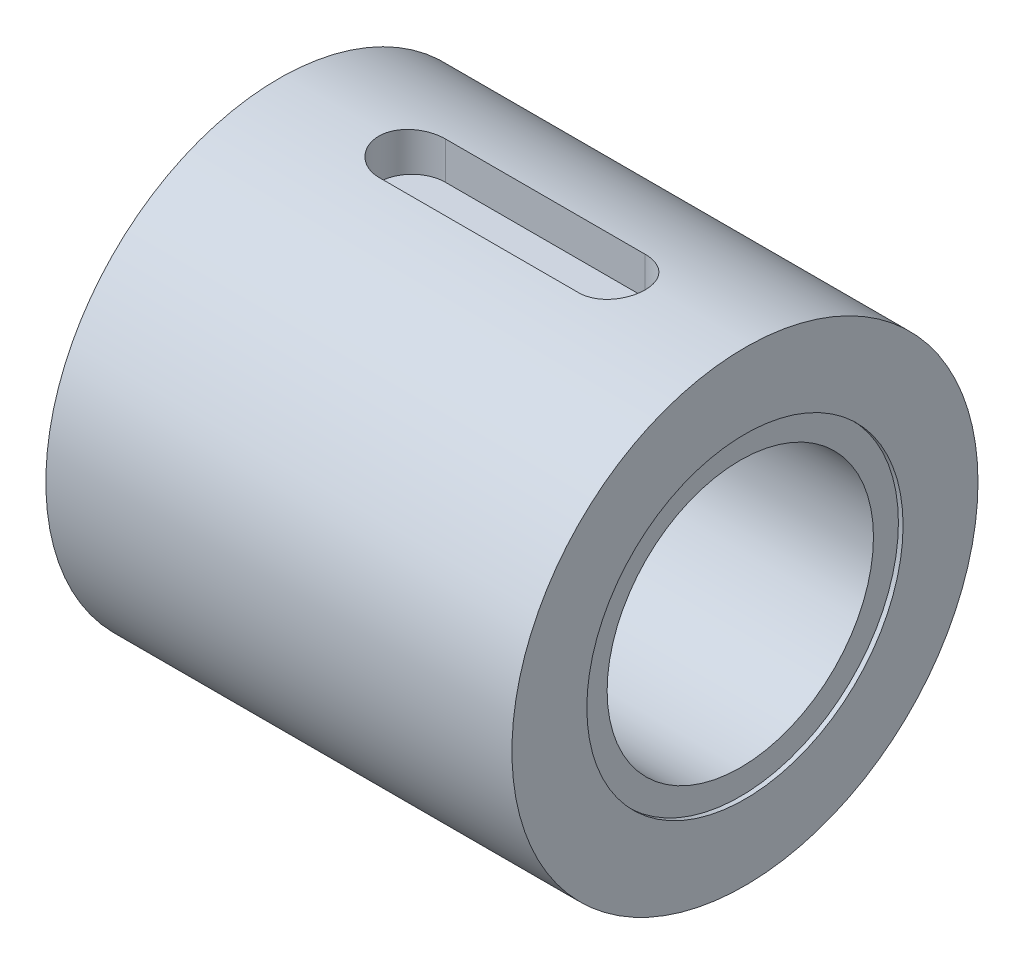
from build123d import *

# Parameters (mm, degrees)
SKETCH1_R          = 7
SKETCH1_R_2        = 4
EXTRUDE1_DEPTH     = 14
CUT_EXTRUDE1_START = -0.14
SKETCH2_R          = 4.7495
SKETCH2_R_2        = 4
CUT_EXTRUDE1_DEPTH = 0.14
SKETCH3_R          = 4.7495
SKETCH3_R_2        = 4
CUT_EXTRUDE2_DEPTH = 0.14
CUT_EXTRUDE3_DEPTH = 1.2


with BuildPart() as part:
    # Sketch1 → Extrude1 (new body)
    with BuildSketch(Plane(origin=(0, 0, 0), x_dir=(0, 0, -1), z_dir=(1, 0, 0))):
        Circle(SKETCH1_R)
        Circle(SKETCH1_R_2, mode=Mode.SUBTRACT)
    extrude(amount=EXTRUDE1_DEPTH)

    # Sketch2 → Cut-Extrude1 (cut)
    with BuildSketch(Plane(origin=(14, 0, 0), x_dir=(0, 0, -1), z_dir=(1, 0, 0)).offset(CUT_EXTRUDE1_START)):
        Circle(SKETCH2_R)
        Circle(SKETCH2_R_2, mode=Mode.SUBTRACT)
    extrude(amount=CUT_EXTRUDE1_DEPTH, mode=Mode.SUBTRACT)

    # Sketch3 → Cut-Extrude2 (cut)
    with BuildSketch(Plane.ZY):
        with Locations(Location((0, 0, 0), (0, 0, 180))):
            Circle(SKETCH3_R)
        Circle(SKETCH3_R_2, mode=Mode.SUBTRACT)
    extrude(amount=-CUT_EXTRUDE2_DEPTH, mode=Mode.SUBTRACT)

    # Sketch4 → Cut-Extrude3 (cut)
    with BuildSketch(Plane(origin=(0, 7, 0), x_dir=(-1, 0, 0), z_dir=(0, 1, 0))):
        with BuildLine():
            Line((-10, -1), (-4, -1))
            ThreePointArc((-4, -1), (-3, 0), (-4, 1))
            Line((-4, 1), (-10, 1))
            ThreePointArc((-10, 1), (-11, 0), (-10, -1))
        make_face()
    extrude(amount=-CUT_EXTRUDE3_DEPTH, mode=Mode.SUBTRACT)


solid = part.part
